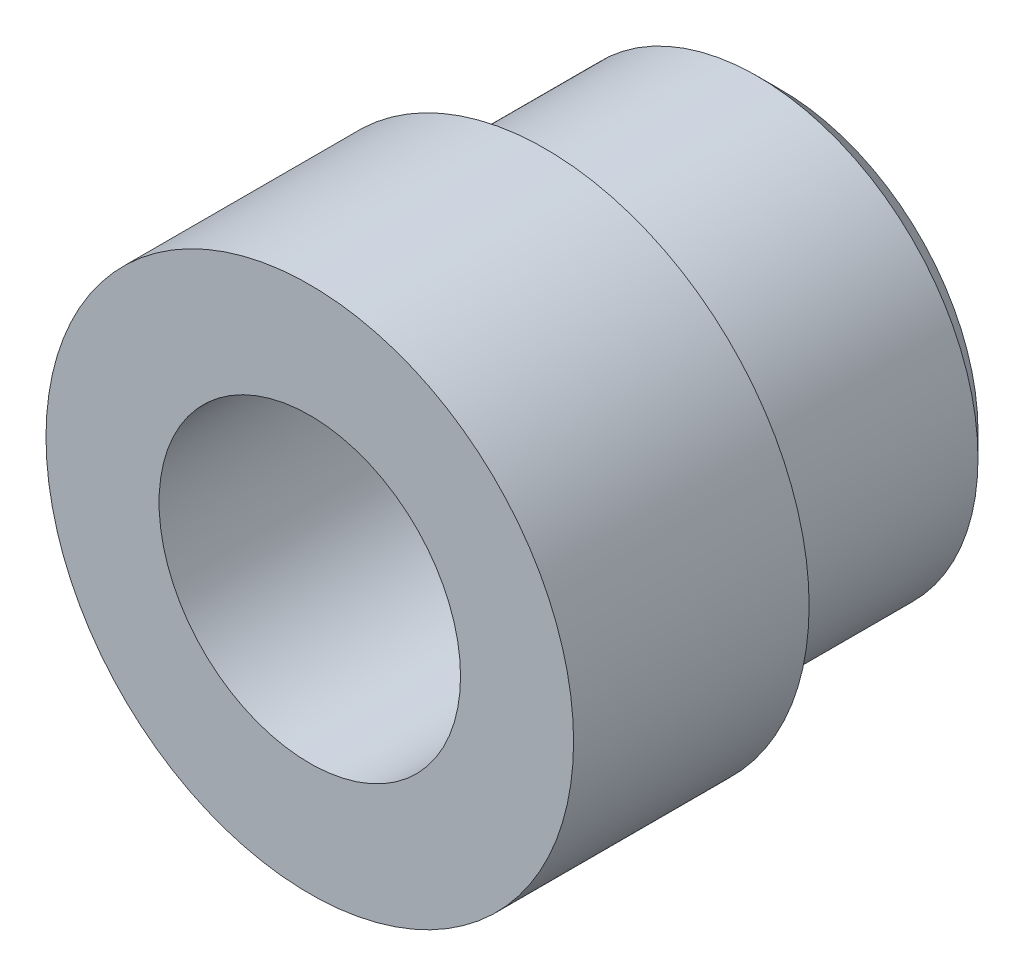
from build123d import *


with BuildPart() as part:
    # Sketch1 → Revolve1 (revolve)
    with BuildSketch(Plane(origin=(0, 0, 0), x_dir=(0, 0, -1), z_dir=(1, 0, 0)), mode=Mode.PRIVATE) as revolve1_sk:
        Polygon((22.744965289, 8.128), (22.744965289, 14.224), (35.444965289, 14.224), (35.444965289, 10.6299), (36.714965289, 11.8999), (46.874965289, 11.8999), (48.144965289, 10.6299), (48.144965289, 8.128), align=None)
    revolve(revolve1_sk.sketch.rotate(Axis((0, 0, 0), (0, 0, -1)), 90), axis=Axis((0, 0, 0), (0, 0, -1)))


solid = part.part
